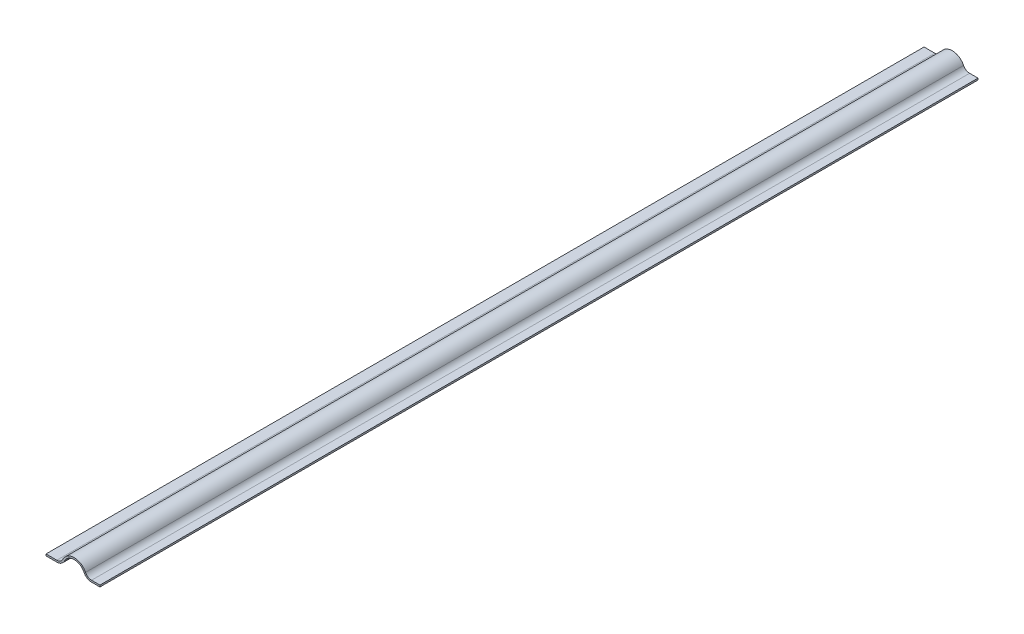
ISO-10303-21;
HEADER;
FILE_DESCRIPTION(('STEP AP214'),'2;1');
FILE_NAME('part.step','',(''),(''),'','','');
FILE_SCHEMA(('AUTOMOTIVE_DESIGN { 1 0 10303 214 1 1 1 1 }'));
ENDSEC;
DATA;
#1=APPLICATION_CONTEXT('core data for automotive mechanical design processes');
#2=APPLICATION_PROTOCOL_DEFINITION('international standard','automotive_design',2000,#1);
#3=PRODUCT_CONTEXT('',#1,'mechanical');
#4=PRODUCT('Part','Part','',(#3));
#5=PRODUCT_RELATED_PRODUCT_CATEGORY('part','',(#4));
#6=PRODUCT_DEFINITION_FORMATION('','',#4);
#7=PRODUCT_DEFINITION_CONTEXT('part definition',#1,'design');
#8=PRODUCT_DEFINITION('design','',#6,#7);
#9=PRODUCT_DEFINITION_SHAPE('','',#8);
#10=(LENGTH_UNIT() NAMED_UNIT(*) SI_UNIT(.MILLI.,.METRE.));
#11=(NAMED_UNIT(*) PLANE_ANGLE_UNIT() SI_UNIT($,.RADIAN.));
#12=(NAMED_UNIT(*) SI_UNIT($,.STERADIAN.) SOLID_ANGLE_UNIT());
#13=UNCERTAINTY_MEASURE_WITH_UNIT(LENGTH_MEASURE(1.E-05),#10,'distance_accuracy_value','');
#14=(GEOMETRIC_REPRESENTATION_CONTEXT(3) GLOBAL_UNCERTAINTY_ASSIGNED_CONTEXT((#13)) GLOBAL_UNIT_ASSIGNED_CONTEXT((#10,
#11,#12)) REPRESENTATION_CONTEXT('',''));
#15=CARTESIAN_POINT('',(0.,0.,0.));
#16=DIRECTION('',(0.,0.,1.));
#17=DIRECTION('',(1.,0.,0.));
#18=AXIS2_PLACEMENT_3D('',#15,#16,#17);
#19=CARTESIAN_POINT('',(5.17754237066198,2.508,-130.96888163));
#20=DIRECTION('',(0.,0.,1.));
#21=DIRECTION('',(1.,0.,0.));
#22=AXIS2_PLACEMENT_3D('',#19,#20,#21);
#23=CYLINDRICAL_SURFACE('',#22,2.508);
#24=CARTESIAN_POINT('',(5.17754237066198,2.508,130.96888163));
#25=DIRECTION('',(0.,0.,1.));
#26=DIRECTION('',(-1.,0.,0.));
#27=AXIS2_PLACEMENT_3D('',#24,#25,#26);
#28=CIRCLE('',#27,2.508);
#29=CARTESIAN_POINT('',(2.92041108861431,1.41464627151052,130.96888163));
#30=VERTEX_POINT('',#29);
#31=CARTESIAN_POINT('',(5.17754237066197,0.,130.96888163));
#32=VERTEX_POINT('',#31);
#33=EDGE_CURVE('E155',#30,#32,#28,.T.);
#34=ORIENTED_EDGE('',*,*,#33,.F.);
#35=DIRECTION('',(0.,0.,1.));
#36=VECTOR('',#35,1.);
#37=CARTESIAN_POINT('',(2.92041108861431,1.41464627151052,-130.96888163));
#38=LINE('',#37,#36);
#39=CARTESIAN_POINT('',(2.92041108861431,1.41464627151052,-130.96888163));
#40=VERTEX_POINT('',#39);
#41=EDGE_CURVE('E11',#40,#30,#38,.T.);
#42=ORIENTED_EDGE('',*,*,#41,.F.);
#43=CARTESIAN_POINT('',(5.17754237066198,2.508,-130.96888163));
#44=DIRECTION('',(0.,0.,1.));
#45=DIRECTION('',(-1.,0.,0.));
#46=AXIS2_PLACEMENT_3D('',#43,#44,#45);
#47=CIRCLE('',#46,2.508);
#48=CARTESIAN_POINT('',(5.17754237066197,0.,-130.96888163));
#49=VERTEX_POINT('',#48);
#50=EDGE_CURVE('E187',#40,#49,#47,.T.);
#51=ORIENTED_EDGE('',*,*,#50,.T.);
#52=DIRECTION('',(0.,0.,1.));
#53=VECTOR('',#52,1.);
#54=CARTESIAN_POINT('',(5.17754237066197,0.,-130.96888163));
#55=LINE('',#54,#53);
#56=EDGE_CURVE('E37',#49,#32,#55,.T.);
#57=ORIENTED_EDGE('',*,*,#56,.T.);
#58=EDGE_LOOP('',(#34,#42,#51,#57));
#59=FACE_BOUND('',#58,.T.);
#60=ADVANCED_FACE('F34',(#59),#23,.T.);
#61=CARTESIAN_POINT('',(0.,0.,-130.96888163));
#62=DIRECTION('',(0.,0.,1.));
#63=DIRECTION('',(1.,0.,0.));
#64=AXIS2_PLACEMENT_3D('',#61,#62,#63);
#65=CYLINDRICAL_SURFACE('',#64,3.245);
#66=CARTESIAN_POINT('',(0.,0.,130.96888163));
#67=DIRECTION('',(0.,0.,-1.));
#68=DIRECTION('',(-1.,0.,0.));
#69=AXIS2_PLACEMENT_3D('',#66,#67,#68);
#70=CIRCLE('',#69,3.245);
#71=CARTESIAN_POINT('',(-2.92041108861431,1.41464627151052,130.96888163));
#72=VERTEX_POINT('',#71);
#73=EDGE_CURVE('E185',#72,#30,#70,.T.);
#74=ORIENTED_EDGE('',*,*,#73,.F.);
#75=DIRECTION('',(0.,0.,1.));
#76=VECTOR('',#75,1.);
#77=CARTESIAN_POINT('',(-2.92041108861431,1.41464627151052,-130.96888163));
#78=LINE('',#77,#76);
#79=CARTESIAN_POINT('',(-2.92041108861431,1.41464627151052,-130.96888163));
#80=VERTEX_POINT('',#79);
#81=EDGE_CURVE('E43',#80,#72,#78,.T.);
#82=ORIENTED_EDGE('',*,*,#81,.F.);
#83=CARTESIAN_POINT('',(0.,0.,-130.96888163));
#84=DIRECTION('',(0.,0.,-1.));
#85=DIRECTION('',(-1.,0.,0.));
#86=AXIS2_PLACEMENT_3D('',#83,#84,#85);
#87=CIRCLE('',#86,3.245);
#88=EDGE_CURVE('E145',#80,#40,#87,.T.);
#89=ORIENTED_EDGE('',*,*,#88,.T.);
#90=ORIENTED_EDGE('',*,*,#41,.T.);
#91=EDGE_LOOP('',(#74,#82,#89,#90));
#92=FACE_BOUND('',#91,.T.);
#93=ADVANCED_FACE('F207',(#92),#65,.F.);
#94=CARTESIAN_POINT('',(-5.17754237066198,2.508,-130.96888163));
#95=DIRECTION('',(0.,0.,1.));
#96=DIRECTION('',(1.,0.,0.));
#97=AXIS2_PLACEMENT_3D('',#94,#95,#96);
#98=CYLINDRICAL_SURFACE('',#97,2.508);
#99=CARTESIAN_POINT('',(-5.17754237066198,2.508,130.96888163));
#100=DIRECTION('',(0.,0.,1.));
#101=DIRECTION('',(1.,0.,0.));
#102=AXIS2_PLACEMENT_3D('',#99,#100,#101);
#103=CIRCLE('',#102,2.508);
#104=CARTESIAN_POINT('',(-5.17754237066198,0.,130.96888163));
#105=VERTEX_POINT('',#104);
#106=EDGE_CURVE('E132',#105,#72,#103,.T.);
#107=ORIENTED_EDGE('',*,*,#106,.F.);
#108=DIRECTION('',(0.,0.,1.));
#109=VECTOR('',#108,1.);
#110=CARTESIAN_POINT('',(-5.17754237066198,0.,-130.96888163));
#111=LINE('',#110,#109);
#112=CARTESIAN_POINT('',(-5.17754237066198,0.,-130.96888163));
#113=VERTEX_POINT('',#112);
#114=EDGE_CURVE('E127',#113,#105,#111,.T.);
#115=ORIENTED_EDGE('',*,*,#114,.F.);
#116=CARTESIAN_POINT('',(-5.17754237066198,2.508,-130.96888163));
#117=DIRECTION('',(0.,0.,1.));
#118=DIRECTION('',(1.,0.,0.));
#119=AXIS2_PLACEMENT_3D('',#116,#117,#118);
#120=CIRCLE('',#119,2.508);
#121=EDGE_CURVE('E130',#113,#80,#120,.T.);
#122=ORIENTED_EDGE('',*,*,#121,.T.);
#123=ORIENTED_EDGE('',*,*,#81,.T.);
#124=EDGE_LOOP('',(#107,#115,#122,#123));
#125=FACE_BOUND('',#124,.T.);
#126=ADVANCED_FACE('F129',(#125),#98,.T.);
#127=CARTESIAN_POINT('',(-8.41145763,0.,-130.96888163));
#128=DIRECTION('',(0.,-1.,0.));
#129=DIRECTION('',(0.,0.,-1.));
#130=AXIS2_PLACEMENT_3D('',#127,#128,#129);
#131=PLANE('',#130);
#132=DIRECTION('',(1.,0.,0.));
#133=VECTOR('',#132,1.);
#134=CARTESIAN_POINT('',(-8.41145763,0.,130.96888163));
#135=LINE('',#134,#133);
#136=CARTESIAN_POINT('',(-8.41145763,0.,130.96888163));
#137=VERTEX_POINT('',#136);
#138=EDGE_CURVE('E182',#137,#105,#135,.T.);
#139=ORIENTED_EDGE('',*,*,#138,.F.);
#140=DIRECTION('',(0.,0.,1.));
#141=VECTOR('',#140,1.);
#142=CARTESIAN_POINT('',(-8.41145763,0.,-130.96888163));
#143=LINE('',#142,#141);
#144=CARTESIAN_POINT('',(-8.41145763,0.,-130.96888163));
#145=VERTEX_POINT('',#144);
#146=EDGE_CURVE('E137',#145,#137,#143,.T.);
#147=ORIENTED_EDGE('',*,*,#146,.F.);
#148=DIRECTION('',(1.,0.,0.));
#149=VECTOR('',#148,1.);
#150=CARTESIAN_POINT('',(-8.41145763,0.,-130.96888163));
#151=LINE('',#150,#149);
#152=EDGE_CURVE('E143',#145,#113,#151,.T.);
#153=ORIENTED_EDGE('',*,*,#152,.T.);
#154=ORIENTED_EDGE('',*,*,#114,.T.);
#155=EDGE_LOOP('',(#139,#147,#153,#154));
#156=FACE_BOUND('',#155,.T.);
#157=ADVANCED_FACE('F147',(#156),#131,.T.);
#158=CARTESIAN_POINT('',(-8.41145763,0.508,-130.96888163));
#159=DIRECTION('',(-1.,0.,0.));
#160=DIRECTION('',(0.,0.,1.));
#161=AXIS2_PLACEMENT_3D('',#158,#159,#160);
#162=PLANE('',#161);
#163=DIRECTION('',(0.,-1.,0.));
#164=VECTOR('',#163,1.);
#165=CARTESIAN_POINT('',(-8.41145763,0.508,130.96888163));
#166=LINE('',#165,#164);
#167=CARTESIAN_POINT('',(-8.41145763,0.508,130.96888163));
#168=VERTEX_POINT('',#167);
#169=EDGE_CURVE('E179',#168,#137,#166,.T.);
#170=ORIENTED_EDGE('',*,*,#169,.F.);
#171=DIRECTION('',(0.,0.,1.));
#172=VECTOR('',#171,1.);
#173=CARTESIAN_POINT('',(-8.41145763,0.508,-130.96888163));
#174=LINE('',#173,#172);
#175=CARTESIAN_POINT('',(-8.41145763,0.508,-130.96888163));
#176=VERTEX_POINT('',#175);
#177=EDGE_CURVE('E191',#176,#168,#174,.T.);
#178=ORIENTED_EDGE('',*,*,#177,.F.);
#179=DIRECTION('',(0.,-1.,0.));
#180=VECTOR('',#179,1.);
#181=CARTESIAN_POINT('',(-8.41145763,0.508,-130.96888163));
#182=LINE('',#181,#180);
#183=EDGE_CURVE('E148',#176,#145,#182,.T.);
#184=ORIENTED_EDGE('',*,*,#183,.T.);
#185=ORIENTED_EDGE('',*,*,#146,.T.);
#186=EDGE_LOOP('',(#170,#178,#184,#185));
#187=FACE_BOUND('',#186,.T.);
#188=ADVANCED_FACE('F220',(#187),#162,.T.);
#189=CARTESIAN_POINT('',(-5.17754237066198,0.508,-130.96888163));
#190=DIRECTION('',(0.,1.,0.));
#191=DIRECTION('',(0.,0.,1.));
#192=AXIS2_PLACEMENT_3D('',#189,#190,#191);
#193=PLANE('',#192);
#194=DIRECTION('',(-1.,0.,0.));
#195=VECTOR('',#194,1.);
#196=CARTESIAN_POINT('',(-5.17754237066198,0.508,130.96888163));
#197=LINE('',#196,#195);
#198=CARTESIAN_POINT('',(-5.17754237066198,0.508,130.96888163));
#199=VERTEX_POINT('',#198);
#200=EDGE_CURVE('E176',#199,#168,#197,.T.);
#201=ORIENTED_EDGE('',*,*,#200,.F.);
#202=DIRECTION('',(0.,0.,1.));
#203=VECTOR('',#202,1.);
#204=CARTESIAN_POINT('',(-5.17754237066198,0.508,-130.96888163));
#205=LINE('',#204,#203);
#206=CARTESIAN_POINT('',(-5.17754237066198,0.508,-130.96888163));
#207=VERTEX_POINT('',#206);
#208=EDGE_CURVE('E193',#207,#199,#205,.T.);
#209=ORIENTED_EDGE('',*,*,#208,.F.);
#210=DIRECTION('',(-1.,0.,0.));
#211=VECTOR('',#210,1.);
#212=CARTESIAN_POINT('',(-5.17754237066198,0.508,-130.96888163));
#213=LINE('',#212,#211);
#214=EDGE_CURVE('E150',#207,#176,#213,.T.);
#215=ORIENTED_EDGE('',*,*,#214,.T.);
#216=ORIENTED_EDGE('',*,*,#177,.T.);
#217=EDGE_LOOP('',(#201,#209,#215,#216));
#218=FACE_BOUND('',#217,.T.);
#219=ADVANCED_FACE('F223',(#218),#193,.T.);
#220=CARTESIAN_POINT('',(-5.17754237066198,2.508,-130.96888163));
#221=DIRECTION('',(0.,0.,1.));
#222=DIRECTION('',(1.,0.,0.));
#223=AXIS2_PLACEMENT_3D('',#220,#221,#222);
#224=CYLINDRICAL_SURFACE('',#223,2.);
#225=CARTESIAN_POINT('',(-5.17754237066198,2.508,130.96888163));
#226=DIRECTION('',(0.,0.,-1.));
#227=DIRECTION('',(-1.,0.,0.));
#228=AXIS2_PLACEMENT_3D('',#225,#226,#227);
#229=CIRCLE('',#228,2.);
#230=CARTESIAN_POINT('',(-3.37759716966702,1.63610707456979,130.96888163));
#231=VERTEX_POINT('',#230);
#232=EDGE_CURVE('E173',#231,#199,#229,.T.);
#233=ORIENTED_EDGE('',*,*,#232,.F.);
#234=DIRECTION('',(0.,0.,1.));
#235=VECTOR('',#234,1.);
#236=CARTESIAN_POINT('',(-3.37759716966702,1.63610707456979,-130.96888163));
#237=LINE('',#236,#235);
#238=CARTESIAN_POINT('',(-3.37759716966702,1.63610707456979,-130.96888163));
#239=VERTEX_POINT('',#238);
#240=EDGE_CURVE('E195',#239,#231,#237,.T.);
#241=ORIENTED_EDGE('',*,*,#240,.F.);
#242=CARTESIAN_POINT('',(-5.17754237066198,2.508,-130.96888163));
#243=DIRECTION('',(0.,0.,-1.));
#244=DIRECTION('',(-1.,0.,0.));
#245=AXIS2_PLACEMENT_3D('',#242,#243,#244);
#246=CIRCLE('',#245,2.);
#247=EDGE_CURVE('E349',#239,#207,#246,.T.);
#248=ORIENTED_EDGE('',*,*,#247,.T.);
#249=ORIENTED_EDGE('',*,*,#208,.T.);
#250=EDGE_LOOP('',(#233,#241,#248,#249));
#251=FACE_BOUND('',#250,.T.);
#252=ADVANCED_FACE('F227',(#251),#224,.F.);
#253=CARTESIAN_POINT('',(0.,0.,-130.96888163));
#254=DIRECTION('',(0.,0.,1.));
#255=DIRECTION('',(1.,0.,0.));
#256=AXIS2_PLACEMENT_3D('',#253,#254,#255);
#257=CYLINDRICAL_SURFACE('',#256,3.753);
#258=CARTESIAN_POINT('',(0.,0.,130.96888163));
#259=DIRECTION('',(0.,0.,1.));
#260=DIRECTION('',(1.,0.,0.));
#261=AXIS2_PLACEMENT_3D('',#258,#259,#260);
#262=CIRCLE('',#261,3.753);
#263=CARTESIAN_POINT('',(3.37759716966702,1.63610707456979,130.96888163));
#264=VERTEX_POINT('',#263);
#265=EDGE_CURVE('E170',#264,#231,#262,.T.);
#266=ORIENTED_EDGE('',*,*,#265,.F.);
#267=DIRECTION('',(0.,0.,1.));
#268=VECTOR('',#267,1.);
#269=CARTESIAN_POINT('',(3.37759716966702,1.63610707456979,-130.96888163));
#270=LINE('',#269,#268);
#271=CARTESIAN_POINT('',(3.37759716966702,1.63610707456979,-130.96888163));
#272=VERTEX_POINT('',#271);
#273=EDGE_CURVE('E197',#272,#264,#270,.T.);
#274=ORIENTED_EDGE('',*,*,#273,.F.);
#275=CARTESIAN_POINT('',(0.,0.,-130.96888163));
#276=DIRECTION('',(0.,0.,1.));
#277=DIRECTION('',(1.,0.,0.));
#278=AXIS2_PLACEMENT_3D('',#275,#276,#277);
#279=CIRCLE('',#278,3.753);
#280=EDGE_CURVE('E353',#272,#239,#279,.T.);
#281=ORIENTED_EDGE('',*,*,#280,.T.);
#282=ORIENTED_EDGE('',*,*,#240,.T.);
#283=EDGE_LOOP('',(#266,#274,#281,#282));
#284=FACE_BOUND('',#283,.T.);
#285=ADVANCED_FACE('F231',(#284),#257,.T.);
#286=CARTESIAN_POINT('',(5.17754237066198,2.508,-130.96888163));
#287=DIRECTION('',(0.,0.,1.));
#288=DIRECTION('',(1.,0.,0.));
#289=AXIS2_PLACEMENT_3D('',#286,#287,#288);
#290=CYLINDRICAL_SURFACE('',#289,2.);
#291=CARTESIAN_POINT('',(5.17754237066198,2.508,130.96888163));
#292=DIRECTION('',(0.,0.,-1.));
#293=DIRECTION('',(1.,0.,0.));
#294=AXIS2_PLACEMENT_3D('',#291,#292,#293);
#295=CIRCLE('',#294,2.);
#296=CARTESIAN_POINT('',(5.17754237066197,0.508,130.96888163));
#297=VERTEX_POINT('',#296);
#298=EDGE_CURVE('E167',#297,#264,#295,.T.);
#299=ORIENTED_EDGE('',*,*,#298,.F.);
#300=DIRECTION('',(0.,0.,1.));
#301=VECTOR('',#300,1.);
#302=CARTESIAN_POINT('',(5.17754237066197,0.508,-130.96888163));
#303=LINE('',#302,#301);
#304=CARTESIAN_POINT('',(5.17754237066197,0.508,-130.96888163));
#305=VERTEX_POINT('',#304);
#306=EDGE_CURVE('E199',#305,#297,#303,.T.);
#307=ORIENTED_EDGE('',*,*,#306,.F.);
#308=CARTESIAN_POINT('',(5.17754237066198,2.508,-130.96888163));
#309=DIRECTION('',(0.,0.,-1.));
#310=DIRECTION('',(1.,0.,0.));
#311=AXIS2_PLACEMENT_3D('',#308,#309,#310);
#312=CIRCLE('',#311,2.);
#313=EDGE_CURVE('E342',#305,#272,#312,.T.);
#314=ORIENTED_EDGE('',*,*,#313,.T.);
#315=ORIENTED_EDGE('',*,*,#273,.T.);
#316=EDGE_LOOP('',(#299,#307,#314,#315));
#317=FACE_BOUND('',#316,.T.);
#318=ADVANCED_FACE('F235',(#317),#290,.F.);
#319=CARTESIAN_POINT('',(5.17754237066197,0.508,-130.96888163));
#320=DIRECTION('',(0.,1.,0.));
#321=DIRECTION('',(-1.,0.,0.));
#322=AXIS2_PLACEMENT_3D('',#319,#320,#321);
#323=PLANE('',#322);
#324=DIRECTION('',(-1.,0.,0.));
#325=VECTOR('',#324,1.);
#326=CARTESIAN_POINT('',(5.17754237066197,0.508,130.96888163));
#327=LINE('',#326,#325);
#328=CARTESIAN_POINT('',(7.67754237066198,0.508000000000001,130.96888163));
#329=VERTEX_POINT('',#328);
#330=EDGE_CURVE('E164',#329,#297,#327,.T.);
#331=ORIENTED_EDGE('',*,*,#330,.F.);
#332=DIRECTION('',(0.,0.,1.));
#333=VECTOR('',#332,1.);
#334=CARTESIAN_POINT('',(7.67754237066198,0.508000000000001,-130.96888163));
#335=LINE('',#334,#333);
#336=CARTESIAN_POINT('',(7.67754237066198,0.508000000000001,-130.96888163));
#337=VERTEX_POINT('',#336);
#338=EDGE_CURVE('E201',#337,#329,#335,.T.);
#339=ORIENTED_EDGE('',*,*,#338,.F.);
#340=DIRECTION('',(-1.,0.,0.));
#341=VECTOR('',#340,1.);
#342=CARTESIAN_POINT('',(5.17754237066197,0.508,-130.96888163));
#343=LINE('',#342,#341);
#344=EDGE_CURVE('E338',#337,#305,#343,.T.);
#345=ORIENTED_EDGE('',*,*,#344,.T.);
#346=ORIENTED_EDGE('',*,*,#306,.T.);
#347=EDGE_LOOP('',(#331,#339,#345,#346));
#348=FACE_BOUND('',#347,.T.);
#349=ADVANCED_FACE('F239',(#348),#323,.T.);
#350=CARTESIAN_POINT('',(7.67754237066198,0.508000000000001,-130.96888163));
#351=DIRECTION('',(1.,0.,0.));
#352=DIRECTION('',(0.,0.,-1.));
#353=AXIS2_PLACEMENT_3D('',#350,#351,#352);
#354=PLANE('',#353);
#355=DIRECTION('',(0.,1.,0.));
#356=VECTOR('',#355,1.);
#357=CARTESIAN_POINT('',(7.67754237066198,0.508000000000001,130.96888163));
#358=LINE('',#357,#356);
#359=CARTESIAN_POINT('',(7.67754237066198,0.,130.96888163));
#360=VERTEX_POINT('',#359);
#361=EDGE_CURVE('E161',#360,#329,#358,.T.);
#362=ORIENTED_EDGE('',*,*,#361,.F.);
#363=DIRECTION('',(0.,0.,1.));
#364=VECTOR('',#363,1.);
#365=CARTESIAN_POINT('',(7.67754237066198,0.,-130.96888163));
#366=LINE('',#365,#364);
#367=CARTESIAN_POINT('',(7.67754237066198,0.,-130.96888163));
#368=VERTEX_POINT('',#367);
#369=EDGE_CURVE('E202',#368,#360,#366,.T.);
#370=ORIENTED_EDGE('',*,*,#369,.F.);
#371=DIRECTION('',(0.,1.,0.));
#372=VECTOR('',#371,1.);
#373=CARTESIAN_POINT('',(7.67754237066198,0.508000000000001,-130.96888163));
#374=LINE('',#373,#372);
#375=EDGE_CURVE('E359',#368,#337,#374,.T.);
#376=ORIENTED_EDGE('',*,*,#375,.T.);
#377=ORIENTED_EDGE('',*,*,#338,.T.);
#378=EDGE_LOOP('',(#362,#370,#376,#377));
#379=FACE_BOUND('',#378,.T.);
#380=ADVANCED_FACE('F243',(#379),#354,.T.);
#381=CARTESIAN_POINT('',(7.67754237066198,0.,-130.96888163));
#382=DIRECTION('',(0.,-1.,0.));
#383=DIRECTION('',(1.,0.,0.));
#384=AXIS2_PLACEMENT_3D('',#381,#382,#383);
#385=PLANE('',#384);
#386=DIRECTION('',(1.,0.,0.));
#387=VECTOR('',#386,1.);
#388=CARTESIAN_POINT('',(7.67754237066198,0.,130.96888163));
#389=LINE('',#388,#387);
#390=EDGE_CURVE('E158',#32,#360,#389,.T.);
#391=ORIENTED_EDGE('',*,*,#390,.F.);
#392=ORIENTED_EDGE('',*,*,#56,.F.);
#393=DIRECTION('',(1.,0.,0.));
#394=VECTOR('',#393,1.);
#395=CARTESIAN_POINT('',(7.67754237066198,0.,-130.96888163));
#396=LINE('',#395,#394);
#397=EDGE_CURVE('E361',#49,#368,#396,.T.);
#398=ORIENTED_EDGE('',*,*,#397,.T.);
#399=ORIENTED_EDGE('',*,*,#369,.T.);
#400=EDGE_LOOP('',(#391,#392,#398,#399));
#401=FACE_BOUND('',#400,.T.);
#402=ADVANCED_FACE('F204',(#401),#385,.T.);
#403=CARTESIAN_POINT('',(5.17754237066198,2.508,-130.96888163));
#404=DIRECTION('',(0.,0.,-1.));
#405=DIRECTION('',(-1.,0.,0.));
#406=AXIS2_PLACEMENT_3D('',#403,#404,#405);
#407=PLANE('',#406);
#408=ORIENTED_EDGE('',*,*,#50,.F.);
#409=ORIENTED_EDGE('',*,*,#88,.F.);
#410=ORIENTED_EDGE('',*,*,#121,.F.);
#411=ORIENTED_EDGE('',*,*,#152,.F.);
#412=ORIENTED_EDGE('',*,*,#183,.F.);
#413=ORIENTED_EDGE('',*,*,#214,.F.);
#414=ORIENTED_EDGE('',*,*,#247,.F.);
#415=ORIENTED_EDGE('',*,*,#280,.F.);
#416=ORIENTED_EDGE('',*,*,#313,.F.);
#417=ORIENTED_EDGE('',*,*,#344,.F.);
#418=ORIENTED_EDGE('',*,*,#375,.F.);
#419=ORIENTED_EDGE('',*,*,#397,.F.);
#420=EDGE_LOOP('',(#408,#409,#410,#411,#412,#413,#414,#415,#416,#417,#418,#419));
#421=FACE_BOUND('',#420,.T.);
#422=ADVANCED_FACE('F141',(#421),#407,.T.);
#423=CARTESIAN_POINT('',(5.17754237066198,2.508,130.96888163));
#424=DIRECTION('',(0.,0.,-1.));
#425=DIRECTION('',(-1.,0.,0.));
#426=AXIS2_PLACEMENT_3D('',#423,#424,#425);
#427=PLANE('',#426);
#428=ORIENTED_EDGE('',*,*,#33,.T.);
#429=ORIENTED_EDGE('',*,*,#390,.T.);
#430=ORIENTED_EDGE('',*,*,#361,.T.);
#431=ORIENTED_EDGE('',*,*,#330,.T.);
#432=ORIENTED_EDGE('',*,*,#298,.T.);
#433=ORIENTED_EDGE('',*,*,#265,.T.);
#434=ORIENTED_EDGE('',*,*,#232,.T.);
#435=ORIENTED_EDGE('',*,*,#200,.T.);
#436=ORIENTED_EDGE('',*,*,#169,.T.);
#437=ORIENTED_EDGE('',*,*,#138,.T.);
#438=ORIENTED_EDGE('',*,*,#106,.T.);
#439=ORIENTED_EDGE('',*,*,#73,.T.);
#440=EDGE_LOOP('',(#428,#429,#430,#431,#432,#433,#434,#435,#436,#437,#438,#439));
#441=FACE_BOUND('',#440,.T.);
#442=ADVANCED_FACE('F206',(#441),#427,.F.);
#443=CLOSED_SHELL('',(#60,#93,#126,#157,#188,#219,#252,#285,#318,#349,#380,#402,#422,#442));
#444=MANIFOLD_SOLID_BREP('B2',#443);
#445=ADVANCED_BREP_SHAPE_REPRESENTATION('',(#18,#444),#14);
#446=SHAPE_DEFINITION_REPRESENTATION(#9,#445);
ENDSEC;
END-ISO-10303-21;
